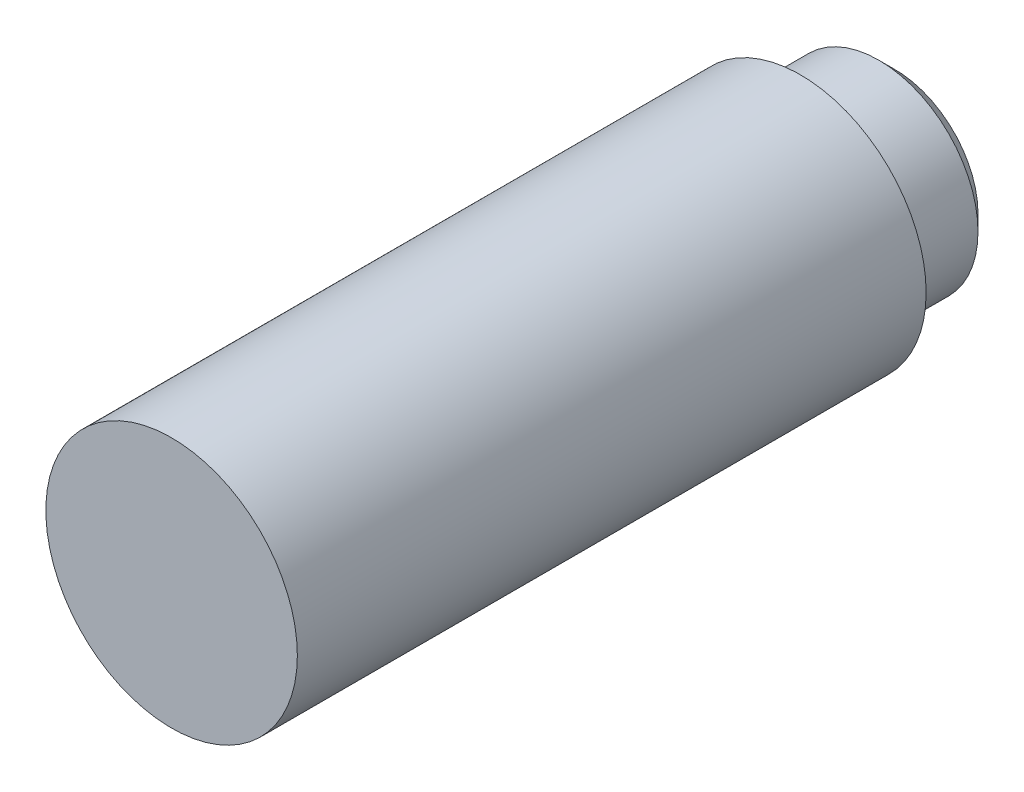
from build123d import *

# Parameters (mm, degrees)
ESQUISSE1_R        = 3.15
BOSS_EXTRU_1_DEPTH = 3
ESQUISSE2_R        = 4
BOSS_EXTRU_2_DEPTH = 20
CHANFREIN1_SIZE    = 0.5


with BuildPart() as part:
    # Esquisse1 → Boss.-Extru.1 (new body)
    with BuildSketch(Plane.XY):
        Circle(ESQUISSE1_R)
    extrude(amount=BOSS_EXTRU_1_DEPTH)

    # Esquisse2 → Boss.-Extru.2 (add)
    with BuildSketch(Plane.XY.offset(3)):
        Circle(ESQUISSE2_R)
    extrude(amount=BOSS_EXTRU_2_DEPTH)

    # Chanfrein1
    chanfrein1_edges = [part.edges().sort_by_distance(p)[0] for p in [
        (-3.15, 0, 0),
    ]]
    chamfer(chanfrein1_edges, length=CHANFREIN1_SIZE)


solid = part.part
